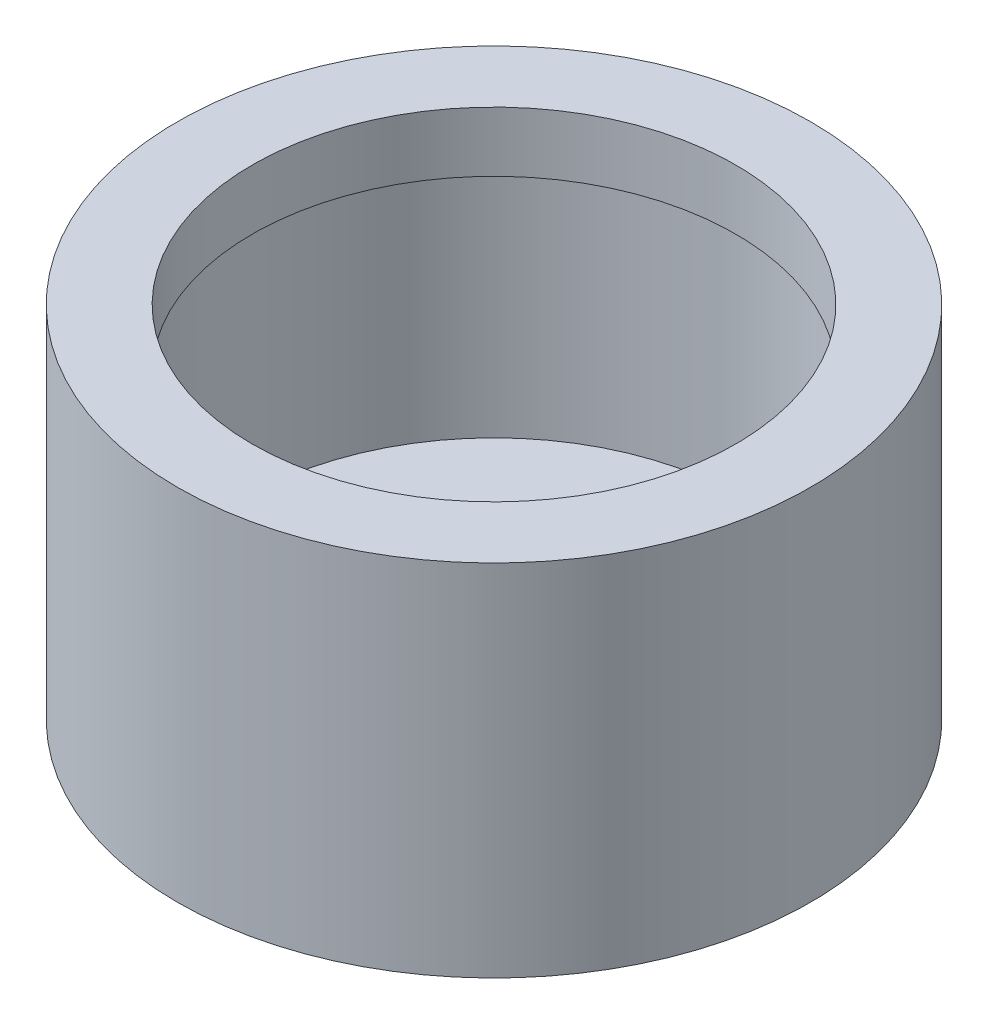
ISO-10303-21;
HEADER;
FILE_DESCRIPTION(('STEP AP214'),'2;1');
FILE_NAME('part.step','',(''),(''),'','','');
FILE_SCHEMA(('AUTOMOTIVE_DESIGN { 1 0 10303 214 1 1 1 1 }'));
ENDSEC;
DATA;
#1=APPLICATION_CONTEXT('core data for automotive mechanical design processes');
#2=APPLICATION_PROTOCOL_DEFINITION('international standard','automotive_design',2000,#1);
#3=PRODUCT_CONTEXT('',#1,'mechanical');
#4=PRODUCT('Part','Part','',(#3));
#5=PRODUCT_RELATED_PRODUCT_CATEGORY('part','',(#4));
#6=PRODUCT_DEFINITION_FORMATION('','',#4);
#7=PRODUCT_DEFINITION_CONTEXT('part definition',#1,'design');
#8=PRODUCT_DEFINITION('design','',#6,#7);
#9=PRODUCT_DEFINITION_SHAPE('','',#8);
#10=(LENGTH_UNIT() NAMED_UNIT(*) SI_UNIT(.MILLI.,.METRE.));
#11=(NAMED_UNIT(*) PLANE_ANGLE_UNIT() SI_UNIT($,.RADIAN.));
#12=(NAMED_UNIT(*) SI_UNIT($,.STERADIAN.) SOLID_ANGLE_UNIT());
#13=UNCERTAINTY_MEASURE_WITH_UNIT(LENGTH_MEASURE(1.E-05),#10,'distance_accuracy_value','');
#14=(GEOMETRIC_REPRESENTATION_CONTEXT(3) GLOBAL_UNCERTAINTY_ASSIGNED_CONTEXT((#13)) GLOBAL_UNIT_ASSIGNED_CONTEXT((#10,
#11,#12)) REPRESENTATION_CONTEXT('',''));
#15=CARTESIAN_POINT('',(0.,0.,0.));
#16=DIRECTION('',(0.,0.,1.));
#17=DIRECTION('',(1.,0.,0.));
#18=AXIS2_PLACEMENT_3D('',#15,#16,#17);
#19=CARTESIAN_POINT('',(18.796,0.,0.));
#20=DIRECTION('',(0.,-1.,0.));
#21=DIRECTION('',(0.,0.,-1.));
#22=AXIS2_PLACEMENT_3D('',#19,#20,#21);
#23=PLANE('',#22);
#24=CARTESIAN_POINT('',(0.,0.,0.));
#25=DIRECTION('',(0.,1.,0.));
#26=DIRECTION('',(0.,0.,1.));
#27=AXIS2_PLACEMENT_3D('',#24,#25,#26);
#28=CIRCLE('',#27,14.351);
#29=CARTESIAN_POINT('',(0.,0.,14.351));
#30=VERTEX_POINT('',#29);
#31=EDGE_CURVE('E11',#30,#30,#28,.T.);
#32=ORIENTED_EDGE('',*,*,#31,.F.);
#33=EDGE_LOOP('',(#32));
#34=FACE_BOUND('',#33,.T.);
#35=CARTESIAN_POINT('',(0.,0.,0.));
#36=DIRECTION('',(0.,1.,0.));
#37=DIRECTION('',(0.,0.,1.));
#38=AXIS2_PLACEMENT_3D('',#35,#36,#37);
#39=CIRCLE('',#38,18.796);
#40=CARTESIAN_POINT('',(0.,0.,18.796));
#41=VERTEX_POINT('',#40);
#42=EDGE_CURVE('E65',#41,#41,#39,.T.);
#43=ORIENTED_EDGE('',*,*,#42,.T.);
#44=EDGE_LOOP('',(#43));
#45=FACE_BOUND('',#44,.T.);
#46=ADVANCED_FACE('F31',(#34,#45),#23,.F.);
#47=CARTESIAN_POINT('',(0.,0.,0.));
#48=DIRECTION('',(0.,1.,0.));
#49=DIRECTION('',(0.,0.,1.));
#50=AXIS2_PLACEMENT_3D('',#47,#48,#49);
#51=CYLINDRICAL_SURFACE('',#50,14.351);
#52=CARTESIAN_POINT('',(0.,-3.556,0.));
#53=DIRECTION('',(0.,1.,0.));
#54=DIRECTION('',(0.,0.,1.));
#55=AXIS2_PLACEMENT_3D('',#52,#53,#54);
#56=CIRCLE('',#55,14.351);
#57=CARTESIAN_POINT('',(0.,-3.556,14.351));
#58=VERTEX_POINT('',#57);
#59=EDGE_CURVE('E38',#58,#58,#56,.T.);
#60=ORIENTED_EDGE('',*,*,#59,.F.);
#61=EDGE_LOOP('',(#60));
#62=FACE_BOUND('',#61,.T.);
#63=ORIENTED_EDGE('',*,*,#31,.T.);
#64=EDGE_LOOP('',(#63));
#65=FACE_BOUND('',#64,.T.);
#66=ADVANCED_FACE('F81',(#62,#65),#51,.F.);
#67=CARTESIAN_POINT('',(14.351,-3.556,0.));
#68=DIRECTION('',(0.,1.,0.));
#69=DIRECTION('',(0.,0.,1.));
#70=AXIS2_PLACEMENT_3D('',#67,#68,#69);
#71=PLANE('',#70);
#72=CARTESIAN_POINT('',(0.,-3.556,0.));
#73=DIRECTION('',(0.,1.,0.));
#74=DIRECTION('',(0.,0.,1.));
#75=AXIS2_PLACEMENT_3D('',#72,#73,#74);
#76=CIRCLE('',#75,14.732);
#77=CARTESIAN_POINT('',(0.,-3.556,14.732));
#78=VERTEX_POINT('',#77);
#79=EDGE_CURVE('E74',#78,#78,#76,.T.);
#80=ORIENTED_EDGE('',*,*,#79,.F.);
#81=EDGE_LOOP('',(#80));
#82=FACE_BOUND('',#81,.T.);
#83=ORIENTED_EDGE('',*,*,#59,.T.);
#84=EDGE_LOOP('',(#83));
#85=FACE_BOUND('',#84,.T.);
#86=ADVANCED_FACE('F79',(#82,#85),#71,.F.);
#87=CARTESIAN_POINT('',(0.,0.,0.));
#88=DIRECTION('',(0.,1.,0.));
#89=DIRECTION('',(0.,0.,1.));
#90=AXIS2_PLACEMENT_3D('',#87,#88,#89);
#91=CYLINDRICAL_SURFACE('',#90,14.732);
#92=CARTESIAN_POINT('',(0.,-17.272,0.));
#93=DIRECTION('',(0.,1.,0.));
#94=DIRECTION('',(0.,0.,1.));
#95=AXIS2_PLACEMENT_3D('',#92,#93,#94);
#96=CIRCLE('',#95,14.732);
#97=CARTESIAN_POINT('',(0.,-17.272,14.732));
#98=VERTEX_POINT('',#97);
#99=EDGE_CURVE('E71',#98,#98,#96,.T.);
#100=ORIENTED_EDGE('',*,*,#99,.F.);
#101=EDGE_LOOP('',(#100));
#102=FACE_BOUND('',#101,.T.);
#103=ORIENTED_EDGE('',*,*,#79,.T.);
#104=EDGE_LOOP('',(#103));
#105=FACE_BOUND('',#104,.T.);
#106=ADVANCED_FACE('F107',(#102,#105),#91,.F.);
#107=CARTESIAN_POINT('',(14.732,-17.272,0.));
#108=DIRECTION('',(0.,-1.,0.));
#109=DIRECTION('',(0.,0.,-1.));
#110=AXIS2_PLACEMENT_3D('',#107,#108,#109);
#111=PLANE('',#110);
#112=ORIENTED_EDGE('',*,*,#99,.T.);
#113=EDGE_LOOP('',(#112));
#114=FACE_BOUND('',#113,.T.);
#115=ADVANCED_FACE('F99',(#114),#111,.F.);
#116=CARTESIAN_POINT('',(0.,-21.336,0.));
#117=DIRECTION('',(0.,1.,0.));
#118=DIRECTION('',(0.,0.,1.));
#119=AXIS2_PLACEMENT_3D('',#116,#117,#118);
#120=PLANE('',#119);
#121=CARTESIAN_POINT('',(-7.62,-21.336,14.732));
#122=DIRECTION('',(0.,-1.,0.));
#123=DIRECTION('',(0.,0.,-1.));
#124=AXIS2_PLACEMENT_3D('',#121,#122,#123);
#125=CIRCLE('',#124,1.13029999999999);
#126=CARTESIAN_POINT('',(-7.62,-21.336,13.6017));
#127=VERTEX_POINT('',#126);
#128=EDGE_CURVE('E55',#127,#127,#125,.T.);
#129=ORIENTED_EDGE('',*,*,#128,.F.);
#130=EDGE_LOOP('',(#129));
#131=FACE_BOUND('',#130,.T.);
#132=CARTESIAN_POINT('',(7.62,-21.336,14.732));
#133=DIRECTION('',(0.,-1.,0.));
#134=DIRECTION('',(0.,0.,-1.));
#135=AXIS2_PLACEMENT_3D('',#132,#133,#134);
#136=CIRCLE('',#135,1.13029999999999);
#137=CARTESIAN_POINT('',(7.62,-21.336,13.6017));
#138=VERTEX_POINT('',#137);
#139=EDGE_CURVE('E54',#138,#138,#136,.T.);
#140=ORIENTED_EDGE('',*,*,#139,.F.);
#141=EDGE_LOOP('',(#140));
#142=FACE_BOUND('',#141,.T.);
#143=CARTESIAN_POINT('',(0.,-21.336,0.));
#144=DIRECTION('',(0.,1.,0.));
#145=DIRECTION('',(0.,0.,1.));
#146=AXIS2_PLACEMENT_3D('',#143,#144,#145);
#147=CIRCLE('',#146,18.796);
#148=CARTESIAN_POINT('',(0.,-21.336,18.796));
#149=VERTEX_POINT('',#148);
#150=EDGE_CURVE('E68',#149,#149,#147,.T.);
#151=ORIENTED_EDGE('',*,*,#150,.F.);
#152=EDGE_LOOP('',(#151));
#153=FACE_BOUND('',#152,.T.);
#154=ADVANCED_FACE('F94',(#131,#142,#153),#120,.F.);
#155=CARTESIAN_POINT('',(0.,0.,0.));
#156=DIRECTION('',(0.,1.,0.));
#157=DIRECTION('',(0.,0.,1.));
#158=AXIS2_PLACEMENT_3D('',#155,#156,#157);
#159=CYLINDRICAL_SURFACE('',#158,18.796);
#160=ORIENTED_EDGE('',*,*,#42,.F.);
#161=EDGE_LOOP('',(#160));
#162=FACE_BOUND('',#161,.T.);
#163=ORIENTED_EDGE('',*,*,#150,.T.);
#164=EDGE_LOOP('',(#163));
#165=FACE_BOUND('',#164,.T.);
#166=ADVANCED_FACE('F90',(#162,#165),#159,.T.);
#167=CARTESIAN_POINT('',(7.62,-16.256,14.732));
#168=DIRECTION('',(0.,-1.,0.));
#169=DIRECTION('',(0.,0.,-1.));
#170=AXIS2_PLACEMENT_3D('',#167,#168,#169);
#171=CONICAL_SURFACE('',#170,1.1303,1.02974425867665);
#172=CARTESIAN_POINT('',(7.62,-15.5768472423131,14.732));
#173=VERTEX_POINT('',#172);
#174=VERTEX_LOOP('',#173);
#175=FACE_BOUND('',#174,.T.);
#176=CARTESIAN_POINT('',(7.62,-16.256,14.732));
#177=DIRECTION('',(0.,-1.,0.));
#178=DIRECTION('',(0.,0.,-1.));
#179=AXIS2_PLACEMENT_3D('',#176,#177,#178);
#180=CIRCLE('',#179,1.1303);
#181=CARTESIAN_POINT('',(7.62,-16.256,13.6017));
#182=VERTEX_POINT('',#181);
#183=EDGE_CURVE('E58',#182,#182,#180,.T.);
#184=ORIENTED_EDGE('',*,*,#183,.T.);
#185=EDGE_LOOP('',(#184));
#186=FACE_BOUND('',#185,.T.);
#187=ADVANCED_FACE('F93',(#175,#186),#171,.F.);
#188=CARTESIAN_POINT('',(7.62,-21.336,14.732));
#189=DIRECTION('',(0.,-1.,0.));
#190=DIRECTION('',(0.,0.,-1.));
#191=AXIS2_PLACEMENT_3D('',#188,#189,#190);
#192=CYLINDRICAL_SURFACE('',#191,1.13029999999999);
#193=ORIENTED_EDGE('',*,*,#183,.F.);
#194=EDGE_LOOP('',(#193));
#195=FACE_BOUND('',#194,.T.);
#196=ORIENTED_EDGE('',*,*,#139,.T.);
#197=EDGE_LOOP('',(#196));
#198=FACE_BOUND('',#197,.T.);
#199=ADVANCED_FACE('F48',(#195,#198),#192,.F.);
#200=CARTESIAN_POINT('',(-7.62,-16.256,14.732));
#201=DIRECTION('',(0.,-1.,0.));
#202=DIRECTION('',(0.,0.,-1.));
#203=AXIS2_PLACEMENT_3D('',#200,#201,#202);
#204=CONICAL_SURFACE('',#203,1.1303,1.02974425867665);
#205=CARTESIAN_POINT('',(-7.62,-15.5768472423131,14.732));
#206=VERTEX_POINT('',#205);
#207=VERTEX_LOOP('',#206);
#208=FACE_BOUND('',#207,.T.);
#209=CARTESIAN_POINT('',(-7.62,-16.256,14.732));
#210=DIRECTION('',(0.,-1.,0.));
#211=DIRECTION('',(0.,0.,-1.));
#212=AXIS2_PLACEMENT_3D('',#209,#210,#211);
#213=CIRCLE('',#212,1.1303);
#214=CARTESIAN_POINT('',(-7.62,-16.256,13.6017));
#215=VERTEX_POINT('',#214);
#216=EDGE_CURVE('E52',#215,#215,#213,.T.);
#217=ORIENTED_EDGE('',*,*,#216,.T.);
#218=EDGE_LOOP('',(#217));
#219=FACE_BOUND('',#218,.T.);
#220=ADVANCED_FACE('F44',(#208,#219),#204,.F.);
#221=CARTESIAN_POINT('',(-7.62,-21.336,14.732));
#222=DIRECTION('',(0.,-1.,0.));
#223=DIRECTION('',(0.,0.,-1.));
#224=AXIS2_PLACEMENT_3D('',#221,#222,#223);
#225=CYLINDRICAL_SURFACE('',#224,1.13029999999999);
#226=ORIENTED_EDGE('',*,*,#216,.F.);
#227=EDGE_LOOP('',(#226));
#228=FACE_BOUND('',#227,.T.);
#229=ORIENTED_EDGE('',*,*,#128,.T.);
#230=EDGE_LOOP('',(#229));
#231=FACE_BOUND('',#230,.T.);
#232=ADVANCED_FACE('F47',(#228,#231),#225,.F.);
#233=CLOSED_SHELL('',(#46,#66,#86,#106,#115,#154,#166,#187,#199,#220,#232));
#234=MANIFOLD_SOLID_BREP('B2',#233);
#235=ADVANCED_BREP_SHAPE_REPRESENTATION('',(#18,#234),#14);
#236=SHAPE_DEFINITION_REPRESENTATION(#9,#235);
ENDSEC;
END-ISO-10303-21;
